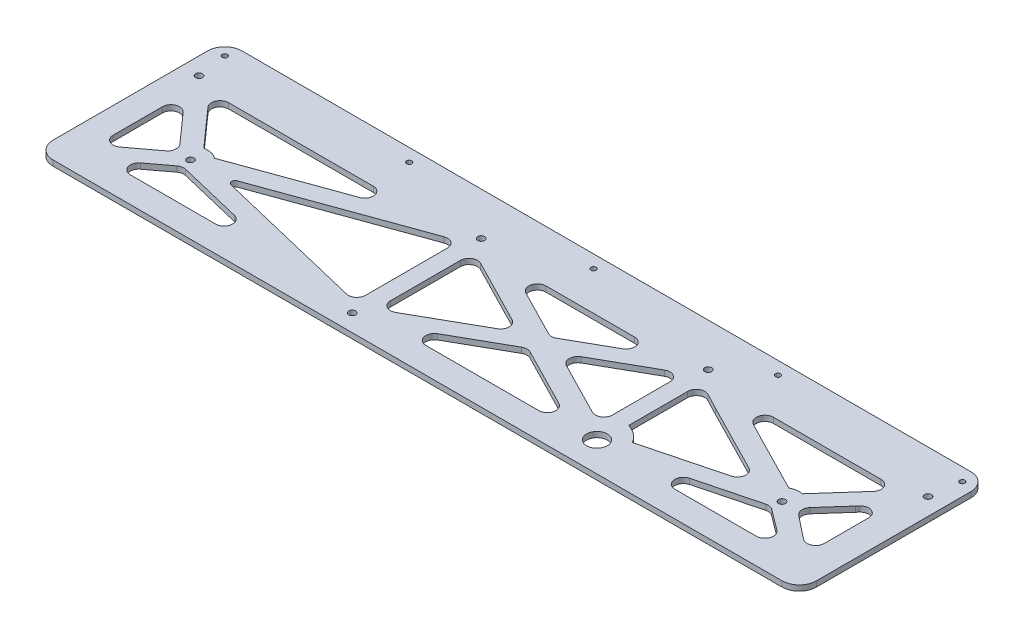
from build123d import *

# Parameters (mm, degrees)
SKETCH1_R           = 2
SKETCH1_R_2         = 6
SKETCH1_R_3         = 1.5
BOSS_EXTRUDE1_DEPTH = 3.175
FILLET1_R           = 10
CUT_EXTRUDE1_DEPTH  = 10


with BuildPart() as part:
    # Sketch1 → Boss-Extrude1 (new body)
    with BuildSketch(Plane(origin=(0, 0, 0), x_dir=(1, 0, 0), z_dir=(0, 1, 0))):
        Polygon((417.700422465, 110), (-26.799577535, 110), (-26.799577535, 0), (417.700422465, 0), (417.700422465, 17.22815868), align=None)
        with Locations(Location((147.450422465, 10, 0), (0, 0, 270))):
            Circle(SKETCH1_R, mode=Mode.SUBTRACT)
        with Locations(Location((23.200422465, 40, 0), (0, 0, 270))):
            Circle(SKETCH1_R, mode=Mode.SUBTRACT)
        with Locations(Location((282.700422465, 17.22815868, 0), (0, 0, 270))):
            Circle(SKETCH1_R_2, mode=Mode.SUBTRACT)
        with Locations(Location((367.700422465, 40, 0), (0, 0, 270))):
            Circle(SKETCH1_R, mode=Mode.SUBTRACT)
        with Locations(Location((-16.799577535, 85, 0), (0, 0, 270))):
            Circle(SKETCH1_R, mode=Mode.SUBTRACT)
        with Locations(Location((-19.299577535, 102.5, 0), (0, 0, 270))):
            Circle(SKETCH1_R_3, mode=Mode.SUBTRACT)
        with Locations(Location((88.075422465, 102.5, 0), (0, 0, 270))):
            Circle(SKETCH1_R_3, mode=Mode.SUBTRACT)
        with Locations(Location((147.450422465, 85, 0), (0, 0, 270))):
            Circle(SKETCH1_R, mode=Mode.SUBTRACT)
        with Locations(Location((279.700422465, 85, 0), (0, 0, 270))):
            Circle(SKETCH1_R, mode=Mode.SUBTRACT)
        with Locations(Location((195.450422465, 102.5, 0), (0, 0, 270))):
            Circle(SKETCH1_R_3, mode=Mode.SUBTRACT)
        with Locations(Location((302.825422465, 102.5, 0), (0, 0, 270))):
            Circle(SKETCH1_R_3, mode=Mode.SUBTRACT)
        with Locations(Location((407.700422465, 85, 0), (0, 0, 270))):
            Circle(SKETCH1_R, mode=Mode.SUBTRACT)
        with Locations(Location((410.200422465, 102.5, 0), (0, 0, 270))):
            Circle(SKETCH1_R_3, mode=Mode.SUBTRACT)
    extrude(amount=BOSS_EXTRUDE1_DEPTH)

    # Fillet1
    fillet1_edges = [part.edges().sort_by_distance(p)[0] for p in [
        (-26.799577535, 1.5875, -110),
        (417.700422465, 1.5875, -110),
        (417.700422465, 1.5875, 0),
        (-26.799577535, 1.5875, 0),
    ]]
    fillet(fillet1_edges, radius=FILLET1_R)

    # Sketch2 → Cut-Extrude1 (cut)
    with BuildSketch(Plane(origin=(0, 3.175, 0), x_dir=(1, 0, 0), z_dir=(0, 1, 0))):
        with BuildLine():
            Line((63.988295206, 24.860334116), (26.456586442, 33.922316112))
            ThreePointArc((26.456586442, 33.922316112), (24.273585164, 33.959016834), (22.283065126, 33.061981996))
            Line((22.283065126, 33.061981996), (10.200422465, 24))
            ThreePointArc((10.200422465, 24), (8.457005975, 18.41886117), (13.200422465, 15))
            Line((13.200422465, 15), (62.81477389, 15))
            ThreePointArc((62.81477389, 15), (67.779734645, 19.409098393), (63.988295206, 24.860334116))
        make_face()
        with BuildLine():
            Line((1.731814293, 71.678180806), (21.183909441, 49.794573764))
            ThreePointArc((21.183909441, 49.794573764), (25.478109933, 49.737152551), (29.35222616, 47.883863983))
            Line((29.35222616, 47.883863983), (83.514557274, 67.5))
            Line((83.514557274, 67.5), (91.361350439, 70.2886824))
            ThreePointArc((91.361350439, 70.2886824), (94.61428981, 75.849532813), (89.686988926, 80))
            Line((89.686988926, 80), (5.468860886, 80))
            ThreePointArc((5.468860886, 80), (0.907660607, 77.048280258), (1.731814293, 71.678180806))
        make_face()
        with BuildLine():
            ThreePointArc((13.203172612, 39.765489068), (13.250707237, 41.001582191), (13.450490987, 42.222349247))
            ThreePointArc((13.450490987, 42.222349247), (13.034220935, 43.599450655), (12.243072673, 44.801021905))
            Line((12.243072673, 44.801021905), (-3.062530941, 62.019825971))
            ThreePointArc((-3.062530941, 62.019825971), (-8.576480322, 63.371615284), (-11.799577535, 58.698006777))
            Line((-11.799577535, 58.698006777), (-11.799577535, 30))
            ThreePointArc((-11.799577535, 30), (-9.035645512, 25.527864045), (-3.799577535, 26))
            Line((-3.799577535, 26), (11.506026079, 37.479202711))
            ThreePointArc((11.506026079, 37.479202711), (12.520785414, 38.498983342), (13.203172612, 39.765489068))
        make_face()
        with BuildLine():
            Line((47.554716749, 39.2633668), (136.276901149, 17.841511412))
            ThreePointArc((136.276901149, 17.841511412), (140.543349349, 18.773257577), (142.450422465, 22.701845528))
            Line((142.450422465, 22.701845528), (142.450422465, 70.404600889))
            ThreePointArc((142.450422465, 70.404600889), (140.32155553, 74.498082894), (135.747784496, 75.105773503))
            Line((135.747784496, 75.105773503), (47.343070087, 43.087969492))
            ThreePointArc((47.343070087, 43.087969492), (46.027180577, 41.096993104), (47.554716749, 39.2633668))
        make_face()
        with BuildLine():
            Line((152.450422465, 67.944146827), (152.450422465, 27.234106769))
            ThreePointArc((152.450422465, 27.234106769), (154.931598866, 22.91490225), (159.912633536, 22.882381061))
            Line((159.912633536, 22.882381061), (197.668168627, 44.244503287))
            ThreePointArc((197.668168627, 44.244503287), (200.204889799, 48.699555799), (197.486244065, 53.045981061))
            Line((197.486244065, 53.045981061), (159.730708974, 72.393898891))
            ThreePointArc((159.730708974, 72.393898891), (154.842878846, 72.210376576), (152.450422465, 67.944146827))
        make_face()
        with BuildLine():
            Line((274.700422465, 34.284011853), (274.700422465, 67.765893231))
            ThreePointArc((274.700422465, 67.765893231), (272.219246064, 72.08509775), (267.238211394, 72.117618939))
            Line((267.238211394, 72.117618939), (236.186256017, 54.548389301))
            ThreePointArc((236.186256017, 54.548389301), (233.649534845, 50.093336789), (236.368180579, 45.746911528))
            Line((236.368180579, 45.746911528), (267.420135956, 29.834259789))
            ThreePointArc((267.420135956, 29.834259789), (272.307966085, 30.017782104), (274.700422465, 34.284011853))
        make_face()
        with BuildLine():
            Line((284.700422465, 68.076898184), (284.700422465, 33.714803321))
            ThreePointArc((284.700422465, 33.714803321), (290.246819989, 30.85104203), (294.408739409, 26.198937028))
            Line((294.408739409, 26.198937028), (340.058508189, 38.011769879))
            ThreePointArc((340.058508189, 38.011769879), (343.775835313, 42.304727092), (341.082359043, 47.304045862))
            Line((341.082359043, 47.304045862), (301.204849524, 67.695954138))
            Line((301.204849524, 67.695954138), (292.020165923, 72.506208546))
            ThreePointArc((292.020165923, 72.506208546), (287.111862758, 72.354673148), (284.700422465, 68.076898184))
        make_face()
        with BuildLine():
            Line((320.393543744, 70.570564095), (326.257240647, 67.5))
            Line((326.257240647, 67.5), (362.890344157, 48.767162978))
            ThreePointArc((362.890344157, 48.767162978), (366.212170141, 49.888635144), (369.716935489, 49.794573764))
            Line((369.716935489, 49.794573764), (389.169030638, 71.678180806))
            ThreePointArc((389.169030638, 71.678180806), (389.993184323, 77.048280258), (385.431984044, 80))
            Line((385.431984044, 80), (322.713047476, 80))
            ThreePointArc((322.713047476, 80), (317.857783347, 76.194324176), (320.393543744, 70.570564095))
        make_face()
        with BuildLine():
            Line((379.559027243, 37.88827322), (390.700422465, 29))
            Line((390.700422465, 29), (393.166651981, 27.150327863))
            ThreePointArc((393.166651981, 27.150327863), (398.402719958, 26.678191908), (401.166651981, 31.150327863))
            Line((401.166651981, 31.150327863), (401.166651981, 57.012678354))
            ThreePointArc((401.166651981, 57.012678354), (397.901307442, 61.70213146), (392.370263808, 60.266512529))
            Line((392.370263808, 60.266512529), (391.437469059, 59.178180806))
            Line((391.437469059, 59.178180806), (378.940138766, 45.118684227))
            ThreePointArc((378.940138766, 45.118684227), (377.695401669, 41.370448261), (379.559027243, 37.88827322))
        make_face()
        with BuildLine():
            Line((364.296086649, 33.954363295), (329.076499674, 24.840558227))
            ThreePointArc((329.076499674, 24.840558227), (325.369116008, 19.368648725), (330.329095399, 15))
            Line((330.329095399, 15), (377.700422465, 15))
            ThreePointArc((377.700422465, 15), (382.443838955, 18.41886117), (380.700422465, 24))
            Line((380.700422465, 24), (368.548682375, 33.113805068))
            ThreePointArc((368.548682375, 33.113805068), (366.518213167, 34.018905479), (364.296086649, 33.954363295))
        make_face()
        with BuildLine():
            Line((185.278283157, 15), (251.008650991, 15))
            ThreePointArc((251.008650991, 15), (255.869142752, 18.82713179), (253.2889375, 24.449752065))
            Line((253.2889375, 24.449752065), (218.797900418, 42.124769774))
            ThreePointArc((218.797900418, 42.124769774), (216.414300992, 42.67395024), (214.055427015, 42.026757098))
            Line((214.055427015, 42.026757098), (182.816096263, 24.351739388))
            ThreePointArc((182.816096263, 24.351739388), (180.443063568, 18.726951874), (185.278283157, 15))
        make_face()
        with BuildLine():
            Line((241.872561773, 80), (190.247225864, 80))
            ThreePointArc((190.247225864, 80), (185.386734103, 76.17286821), (187.966939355, 70.550247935))
            Line((187.966939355, 70.550247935), (215.056569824, 56.668099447))
            ThreePointArc((215.056569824, 56.668099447), (217.44016925, 56.118918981), (219.799043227, 56.766112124))
            Line((219.799043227, 56.766112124), (244.334748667, 70.648260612))
            ThreePointArc((244.334748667, 70.648260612), (246.707781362, 76.273048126), (241.872561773, 80))
        make_face()
    extrude(amount=-CUT_EXTRUDE1_DEPTH, mode=Mode.SUBTRACT)


solid = part.part
